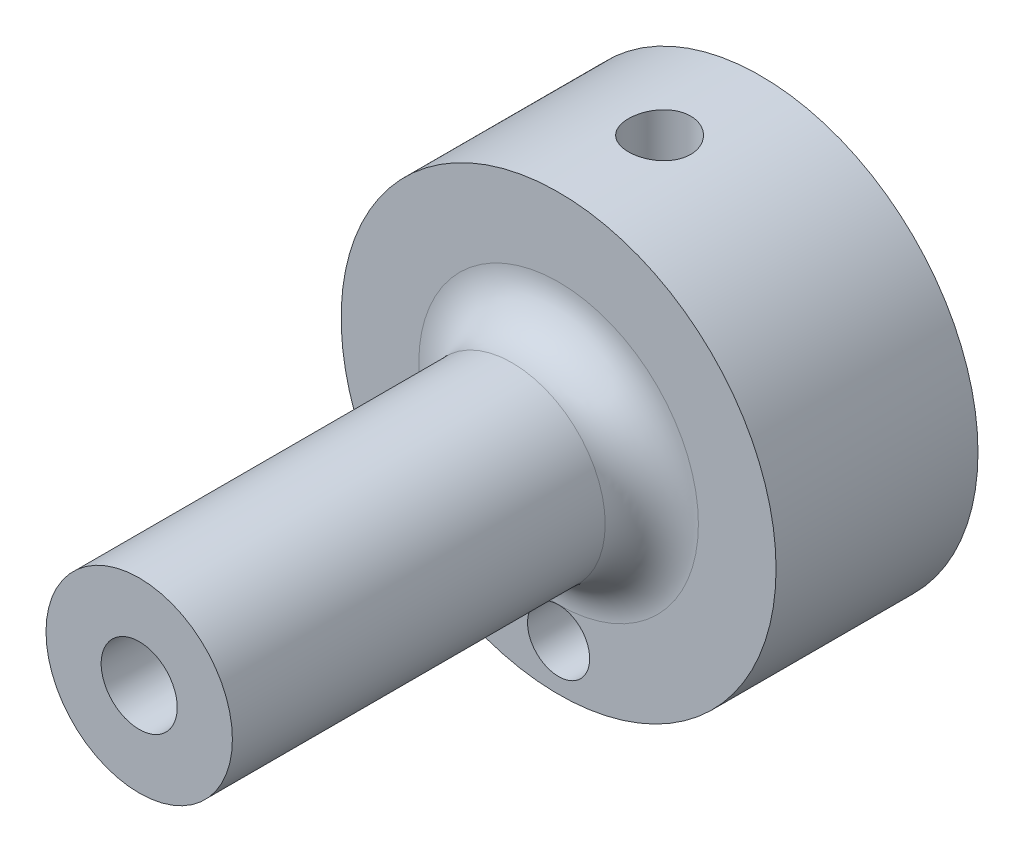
ISO-10303-21;
HEADER;
FILE_DESCRIPTION(('STEP AP214'),'2;1');
FILE_NAME('part.step','',(''),(''),'','','');
FILE_SCHEMA(('AUTOMOTIVE_DESIGN { 1 0 10303 214 1 1 1 1 }'));
ENDSEC;
DATA;
#1=APPLICATION_CONTEXT('core data for automotive mechanical design processes');
#2=APPLICATION_PROTOCOL_DEFINITION('international standard','automotive_design',2000,#1);
#3=PRODUCT_CONTEXT('',#1,'mechanical');
#4=PRODUCT('Part','Part','',(#3));
#5=PRODUCT_RELATED_PRODUCT_CATEGORY('part','',(#4));
#6=PRODUCT_DEFINITION_FORMATION('','',#4);
#7=PRODUCT_DEFINITION_CONTEXT('part definition',#1,'design');
#8=PRODUCT_DEFINITION('design','',#6,#7);
#9=PRODUCT_DEFINITION_SHAPE('','',#8);
#10=(LENGTH_UNIT() NAMED_UNIT(*) SI_UNIT(.MILLI.,.METRE.));
#11=(NAMED_UNIT(*) PLANE_ANGLE_UNIT() SI_UNIT($,.RADIAN.));
#12=(NAMED_UNIT(*) SI_UNIT($,.STERADIAN.) SOLID_ANGLE_UNIT());
#13=UNCERTAINTY_MEASURE_WITH_UNIT(LENGTH_MEASURE(1.E-05),#10,'distance_accuracy_value','');
#14=(GEOMETRIC_REPRESENTATION_CONTEXT(3) GLOBAL_UNCERTAINTY_ASSIGNED_CONTEXT((#13)) GLOBAL_UNIT_ASSIGNED_CONTEXT((#10,
#11,#12)) REPRESENTATION_CONTEXT('',''));
#15=CARTESIAN_POINT('',(0.,0.,0.));
#16=DIRECTION('',(0.,0.,1.));
#17=DIRECTION('',(1.,0.,0.));
#18=AXIS2_PLACEMENT_3D('',#15,#16,#17);
#19=CARTESIAN_POINT('',(0.,0.,27.));
#20=DIRECTION('',(0.,0.,1.));
#21=DIRECTION('',(1.,0.,0.));
#22=AXIS2_PLACEMENT_3D('',#19,#20,#21);
#23=CONICAL_SURFACE('',#22,2.4482025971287,0.0174532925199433);
#24=CARTESIAN_POINT('',(0.,0.,27.));
#25=DIRECTION('',(0.,0.,1.));
#26=DIRECTION('',(1.,0.,0.));
#27=AXIS2_PLACEMENT_3D('',#24,#25,#26);
#28=CIRCLE('',#27,2.4482025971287);
#29=CARTESIAN_POINT('',(2.4482025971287,0.,27.));
#30=VERTEX_POINT('',#29);
#31=EDGE_CURVE('E110',#30,#30,#28,.T.);
#32=ORIENTED_EDGE('',*,*,#31,.T.);
#33=EDGE_LOOP('',(#32));
#34=FACE_BOUND('',#33,.T.);
#35=CARTESIAN_POINT('',(0.,0.,-11.601899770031));
#36=DIRECTION('',(0.,0.,-1.));
#37=DIRECTION('',(-1.,0.,0.));
#38=AXIS2_PLACEMENT_3D('',#35,#36,#37);
#39=CIRCLE('',#38,1.77440393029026);
#40=CARTESIAN_POINT('',(0.,1.77440393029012,-11.601899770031));
#41=VERTEX_POINT('',#40);
#42=EDGE_CURVE('E38',#41,#41,#39,.F.);
#43=ORIENTED_EDGE('',*,*,#42,.F.);
#44=EDGE_LOOP('',(#43));
#45=FACE_BOUND('',#44,.T.);
#46=ADVANCED_FACE('F34',(#34,#45),#23,.F.);
#47=CARTESIAN_POINT('',(0.,0.,27.));
#48=DIRECTION('',(0.,0.,1.));
#49=DIRECTION('',(1.,0.,0.));
#50=AXIS2_PLACEMENT_3D('',#47,#48,#49);
#51=CYLINDRICAL_SURFACE('',#50,14.);
#52=CARTESIAN_POINT('',(0.,0.,0.));
#53=DIRECTION('',(0.,0.,1.));
#54=DIRECTION('',(1.,0.,0.));
#55=AXIS2_PLACEMENT_3D('',#52,#53,#54);
#56=CIRCLE('',#55,14.);
#57=CARTESIAN_POINT('',(14.,0.,0.));
#58=VERTEX_POINT('',#57);
#59=EDGE_CURVE('E104',#58,#58,#56,.T.);
#60=ORIENTED_EDGE('',*,*,#59,.F.);
#61=EDGE_LOOP('',(#60));
#62=FACE_BOUND('',#61,.T.);
#63=CARTESIAN_POINT('',(0.,0.,-13.));
#64=DIRECTION('',(0.,0.,1.));
#65=DIRECTION('',(1.,0.,0.));
#66=AXIS2_PLACEMENT_3D('',#63,#64,#65);
#67=CIRCLE('',#66,14.);
#68=CARTESIAN_POINT('',(14.,0.,-13.));
#69=VERTEX_POINT('',#68);
#70=EDGE_CURVE('E107',#69,#69,#67,.T.);
#71=ORIENTED_EDGE('',*,*,#70,.T.);
#72=EDGE_LOOP('',(#71));
#73=FACE_BOUND('',#72,.T.);
#74=CARTESIAN_POINT('',(0.,14.,-4.5));
#75=CARTESIAN_POINT('',(0.111730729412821,13.9999982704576,-4.50000465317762));
#76=CARTESIAN_POINT('',(0.223527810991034,13.9986484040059,-4.50939441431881));
#77=CARTESIAN_POINT('',(0.444001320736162,13.9933934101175,-4.54669827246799));
#78=CARTESIAN_POINT('',(0.552674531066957,13.9894857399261,-4.57463080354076));
#79=CARTESIAN_POINT('',(0.763677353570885,13.9795546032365,-4.64817212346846));
#80=CARTESIAN_POINT('',(0.866011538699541,13.9735326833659,-4.69376799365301));
#81=CARTESIAN_POINT('',(1.06155930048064,13.9600397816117,-4.80131108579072));
#82=CARTESIAN_POINT('',(1.1547742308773,13.9525690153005,-4.86325587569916));
#83=CARTESIAN_POINT('',(1.33011730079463,13.9369507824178,-5.00220834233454));
#84=CARTESIAN_POINT('',(1.4121711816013,13.9287993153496,-5.07930928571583));
#85=CARTESIAN_POINT('',(1.56222258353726,13.9127699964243,-5.24618482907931));
#86=CARTESIAN_POINT('',(1.63021932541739,13.9048921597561,-5.33596013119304));
#87=CARTESIAN_POINT('',(1.75051175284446,13.8902631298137,-5.52613023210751));
#88=CARTESIAN_POINT('',(1.80273625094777,13.8835171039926,-5.62657049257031));
#89=CARTESIAN_POINT('',(1.8895469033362,13.8719696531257,-5.83490907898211));
#90=CARTESIAN_POINT('',(1.92413392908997,13.8671681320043,-5.94280703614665));
#91=CARTESIAN_POINT('',(1.97445864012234,13.8600923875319,-6.16222001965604));
#92=CARTESIAN_POINT('',(1.99032297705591,13.8578011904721,-6.27370543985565));
#93=CARTESIAN_POINT('',(2.00314420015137,13.8559538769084,-6.4977778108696));
#94=CARTESIAN_POINT('',(2.00010207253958,13.8563976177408,-6.61036470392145));
#95=CARTESIAN_POINT('',(1.97530036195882,13.8599545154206,-6.83255309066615));
#96=CARTESIAN_POINT('',(1.95368136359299,13.8630476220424,-6.94217064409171));
#97=CARTESIAN_POINT('',(1.89255944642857,13.8715234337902,-7.15620617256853));
#98=CARTESIAN_POINT('',(1.85305606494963,13.8769061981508,-7.26062401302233));
#99=CARTESIAN_POINT('',(1.75713904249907,13.8893771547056,-7.46172654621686));
#100=CARTESIAN_POINT('',(1.70066538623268,13.8964713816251,-7.55838222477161));
#101=CARTESIAN_POINT('',(1.57245369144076,13.9115614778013,-7.7408984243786));
#102=CARTESIAN_POINT('',(1.50071474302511,13.9195574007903,-7.82675830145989));
#103=CARTESIAN_POINT('',(1.34323491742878,13.935638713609,-7.98606080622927));
#104=CARTESIAN_POINT('',(1.25737307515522,13.9437242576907,-8.05938389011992));
#105=CARTESIAN_POINT('',(1.07449831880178,13.9590063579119,-8.19059700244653));
#106=CARTESIAN_POINT('',(0.97748536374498,13.9662029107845,-8.24848697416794));
#107=CARTESIAN_POINT('',(0.774962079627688,13.9789027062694,-8.34719487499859));
#108=CARTESIAN_POINT('',(0.66944745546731,13.9844050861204,-8.38800410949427));
#109=CARTESIAN_POINT('',(0.452966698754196,13.9930891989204,-8.4512909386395));
#110=CARTESIAN_POINT('',(0.342000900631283,13.9962710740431,-8.47376965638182));
#111=CARTESIAN_POINT('',(0.118800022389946,13.9999369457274,-8.49959962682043));
#112=CARTESIAN_POINT('',(0.00658433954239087,14.0004441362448,-8.5031153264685));
#113=CARTESIAN_POINT('',(-0.216834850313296,13.998766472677,-8.49135519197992));
#114=CARTESIAN_POINT('',(-0.328038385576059,13.9965816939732,-8.47607988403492));
#115=CARTESIAN_POINT('',(-0.545782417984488,13.989779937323,-8.42730805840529));
#116=CARTESIAN_POINT('',(-0.652341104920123,13.9851735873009,-8.39389114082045));
#117=CARTESIAN_POINT('',(-0.858342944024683,13.9740437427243,-8.30986826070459));
#118=CARTESIAN_POINT('',(-0.957785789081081,13.9675201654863,-8.25926155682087));
#119=CARTESIAN_POINT('',(-1.14745969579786,13.9532237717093,-8.14190618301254));
#120=CARTESIAN_POINT('',(-1.23762521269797,13.9454429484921,-8.07505257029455));
#121=CARTESIAN_POINT('',(-1.40551529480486,13.9295244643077,-7.92724792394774));
#122=CARTESIAN_POINT('',(-1.48323920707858,13.9213867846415,-7.84629615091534));
#123=CARTESIAN_POINT('',(-1.62463364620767,13.905598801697,-7.67186329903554));
#124=CARTESIAN_POINT('',(-1.68819430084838,13.8979526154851,-7.57829272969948));
#125=CARTESIAN_POINT('',(-1.79869568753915,13.8840847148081,-7.38170681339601));
#126=CARTESIAN_POINT('',(-1.84563683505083,13.8778629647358,-7.27869170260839));
#127=CARTESIAN_POINT('',(-1.92139410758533,13.8675777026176,-7.06647669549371));
#128=CARTESIAN_POINT('',(-1.95026930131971,13.8635071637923,-6.95729824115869));
#129=CARTESIAN_POINT('',(-1.98926373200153,13.8579660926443,-6.7355794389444));
#130=CARTESIAN_POINT('',(-1.99938413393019,13.8564953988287,-6.62303930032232));
#131=CARTESIAN_POINT('',(-2.00055590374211,13.8563261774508,-6.39888617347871));
#132=CARTESIAN_POINT('',(-1.99177997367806,13.8576025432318,-6.28727406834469));
#133=CARTESIAN_POINT('',(-1.955776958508,13.8627292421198,-6.06712987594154));
#134=CARTESIAN_POINT('',(-1.92854989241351,13.8665795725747,-5.95859778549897));
#135=CARTESIAN_POINT('',(-1.85647645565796,13.8764118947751,-5.74773473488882));
#136=CARTESIAN_POINT('',(-1.81164102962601,13.8823925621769,-5.64539996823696));
#137=CARTESIAN_POINT('',(-1.70564064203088,13.8958134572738,-5.4496775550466));
#138=CARTESIAN_POINT('',(-1.6444752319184,13.9032537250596,-5.35629015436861));
#139=CARTESIAN_POINT('',(-1.50691947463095,13.9188366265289,-5.18023418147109));
#140=CARTESIAN_POINT('',(-1.43040092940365,13.9269848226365,-5.09766625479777));
#141=CARTESIAN_POINT('',(-1.26458151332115,13.9430182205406,-4.94648029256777));
#142=CARTESIAN_POINT('',(-1.17527766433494,13.9509033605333,-4.87786551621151));
#143=CARTESIAN_POINT('',(-0.985903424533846,13.9655666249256,-4.75623242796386));
#144=CARTESIAN_POINT('',(-0.885781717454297,13.9723390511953,-4.70329334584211));
#145=CARTESIAN_POINT('',(-0.678021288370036,13.9839575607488,-4.6150602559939));
#146=CARTESIAN_POINT('',(-0.570390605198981,13.9888056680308,-4.57974769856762));
#147=CARTESIAN_POINT('',(-0.385211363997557,13.9949036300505,-4.53591641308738));
#148=CARTESIAN_POINT('',(-0.308813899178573,13.9968051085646,-4.52246796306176));
#149=CARTESIAN_POINT('',(-0.154954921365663,13.9993538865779,-4.5045081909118));
#150=CARTESIAN_POINT('',(-0.0774934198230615,14.0000011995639,-4.49999677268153));
#151=CARTESIAN_POINT('',(0.,14.,-4.5));
#152=B_SPLINE_CURVE_WITH_KNOTS('',3,(#74,#75,#76,#77,#78,#79,#80,#81,#82,#83,#84,#85,#86,#87,
#88,#89,#90,#91,#92,#93,#94,#95,#96,#97,#98,#99,#100,#101,#102,#103,#104,#105,#106,#107,#108,
#109,#110,#111,#112,#113,#114,#115,#116,#117,#118,#119,#120,#121,#122,#123,#124,#125,#126,#127,
#128,#129,#130,#131,#132,#133,#134,#135,#136,#137,#138,#139,#140,#141,#142,#143,#144,#145,#146,
#147,#148,#149,#150,#151),.UNSPECIFIED.,.T.,.F.,(4,2,2,2,2,2,2,2,2,2,2,2,2,2,2,2,2,2,2,2,2,2,2,
2,2,2,2,2,2,2,2,2,2,2,2,2,2,2,4),(0.,0.334909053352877,0.670151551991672,1.0051493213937,
1.34009728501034,1.67717486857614,2.01427113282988,2.35286688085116,2.69144589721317,
3.02772118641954,3.36397893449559,3.69771416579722,4.03145803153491,4.36639635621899,
4.70135465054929,5.03934756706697,5.37734172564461,5.71550772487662,6.05365300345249,
6.38886112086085,6.7240598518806,7.05779957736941,7.39155369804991,7.7275237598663,
8.06351144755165,8.40202124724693,8.74052258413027,9.0779112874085,9.41527903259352,
9.74957651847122,10.0838736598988,10.4179633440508,10.7520622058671,11.0890764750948,
11.4261693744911,11.7649380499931,12.1033494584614,12.3356358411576,12.5679197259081),.UNSPECIFIED.);
#153=CARTESIAN_POINT('',(0.,14.,-4.5));
#154=VERTEX_POINT('',#153);
#155=EDGE_CURVE('E11',#154,#154,#152,.T.);
#156=ORIENTED_EDGE('',*,*,#155,.F.);
#157=EDGE_LOOP('',(#156));
#158=FACE_BOUND('',#157,.T.);
#159=ADVANCED_FACE('F71',(#62,#73,#158),#51,.T.);
#160=CARTESIAN_POINT('',(0.,6.,27.));
#161=DIRECTION('',(0.,0.,-1.));
#162=DIRECTION('',(-1.,0.,0.));
#163=AXIS2_PLACEMENT_3D('',#160,#161,#162);
#164=PLANE('',#163);
#165=ORIENTED_EDGE('',*,*,#31,.F.);
#166=EDGE_LOOP('',(#165));
#167=FACE_BOUND('',#166,.T.);
#168=CARTESIAN_POINT('',(0.,0.,27.));
#169=DIRECTION('',(0.,0.,1.));
#170=DIRECTION('',(1.,0.,0.));
#171=AXIS2_PLACEMENT_3D('',#168,#169,#170);
#172=CIRCLE('',#171,6.);
#173=CARTESIAN_POINT('',(6.,0.,27.));
#174=VERTEX_POINT('',#173);
#175=EDGE_CURVE('E43',#174,#174,#172,.T.);
#176=ORIENTED_EDGE('',*,*,#175,.T.);
#177=EDGE_LOOP('',(#176));
#178=FACE_BOUND('',#177,.T.);
#179=ADVANCED_FACE('F36',(#167,#178),#164,.F.);
#180=CARTESIAN_POINT('',(0.,0.,27.));
#181=DIRECTION('',(0.,0.,1.));
#182=DIRECTION('',(1.,0.,0.));
#183=AXIS2_PLACEMENT_3D('',#180,#181,#182);
#184=CYLINDRICAL_SURFACE('',#183,6.);
#185=ORIENTED_EDGE('',*,*,#175,.F.);
#186=EDGE_LOOP('',(#185));
#187=FACE_BOUND('',#186,.T.);
#188=CARTESIAN_POINT('',(0.,0.,3.));
#189=DIRECTION('',(0.,0.,1.));
#190=DIRECTION('',(1.,0.,0.));
#191=AXIS2_PLACEMENT_3D('',#188,#189,#190);
#192=CIRCLE('',#191,6.);
#193=CARTESIAN_POINT('',(6.,0.,3.));
#194=VERTEX_POINT('',#193);
#195=EDGE_CURVE('E98',#194,#194,#192,.T.);
#196=ORIENTED_EDGE('',*,*,#195,.T.);
#197=EDGE_LOOP('',(#196));
#198=FACE_BOUND('',#197,.T.);
#199=ADVANCED_FACE('F179',(#187,#198),#184,.T.);
#200=CARTESIAN_POINT('',(0.,0.,3.));
#201=DIRECTION('',(0.,0.,1.));
#202=DIRECTION('',(1.,0.,0.));
#203=AXIS2_PLACEMENT_3D('',#200,#201,#202);
#204=TOROIDAL_SURFACE('',#203,9.,3.);
#205=ORIENTED_EDGE('',*,*,#195,.F.);
#206=EDGE_LOOP('',(#205));
#207=FACE_BOUND('',#206,.T.);
#208=CARTESIAN_POINT('',(0.,0.,0.));
#209=DIRECTION('',(0.,0.,1.));
#210=DIRECTION('',(1.,0.,0.));
#211=AXIS2_PLACEMENT_3D('',#208,#209,#210);
#212=CIRCLE('',#211,9.00000000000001);
#213=CARTESIAN_POINT('',(0.,-9.00000000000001,0.));
#214=VERTEX_POINT('',#213);
#215=EDGE_CURVE('E101',#214,#214,#212,.T.);
#216=ORIENTED_EDGE('',*,*,#215,.T.);
#217=EDGE_LOOP('',(#216));
#218=FACE_BOUND('',#217,.T.);
#219=ADVANCED_FACE('F175',(#207,#218),#204,.F.);
#220=CARTESIAN_POINT('',(0.,14.,0.));
#221=DIRECTION('',(0.,0.,-1.));
#222=DIRECTION('',(-1.,0.,0.));
#223=AXIS2_PLACEMENT_3D('',#220,#221,#222);
#224=PLANE('',#223);
#225=ORIENTED_EDGE('',*,*,#215,.F.);
#226=CARTESIAN_POINT('',(0.,-11.,0.));
#227=DIRECTION('',(0.,0.,1.));
#228=DIRECTION('',(1.,0.,0.));
#229=AXIS2_PLACEMENT_3D('',#226,#227,#228);
#230=CIRCLE('',#229,2.);
#231=EDGE_CURVE('E48',#214,#214,#230,.T.);
#232=ORIENTED_EDGE('',*,*,#231,.F.);
#233=EDGE_LOOP('',(#225,#232));
#234=FACE_BOUND('',#233,.T.);
#235=ORIENTED_EDGE('',*,*,#59,.T.);
#236=EDGE_LOOP('',(#235));
#237=FACE_BOUND('',#236,.T.);
#238=ADVANCED_FACE('F88',(#234,#237),#224,.F.);
#239=CARTESIAN_POINT('',(0.,1.75,-13.));
#240=DIRECTION('',(0.,0.,1.));
#241=DIRECTION('',(1.,0.,0.));
#242=AXIS2_PLACEMENT_3D('',#239,#240,#241);
#243=PLANE('',#242);
#244=CARTESIAN_POINT('',(0.,0.,-13.));
#245=DIRECTION('',(0.,0.,1.));
#246=DIRECTION('',(1.,0.,0.));
#247=AXIS2_PLACEMENT_3D('',#244,#245,#246);
#248=CIRCLE('',#247,6.65206734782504);
#249=CARTESIAN_POINT('',(0.,6.65206734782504,-13.));
#250=VERTEX_POINT('',#249);
#251=EDGE_CURVE('E118',#250,#250,#248,.T.);
#252=ORIENTED_EDGE('',*,*,#251,.T.);
#253=EDGE_LOOP('',(#252));
#254=FACE_BOUND('',#253,.T.);
#255=ORIENTED_EDGE('',*,*,#70,.F.);
#256=EDGE_LOOP('',(#255));
#257=FACE_BOUND('',#256,.T.);
#258=ADVANCED_FACE('F86',(#254,#257),#243,.F.);
#259=CARTESIAN_POINT('',(0.,14.,-6.5));
#260=DIRECTION('',(0.,1.,0.));
#261=DIRECTION('',(0.,0.,1.));
#262=AXIS2_PLACEMENT_3D('',#259,#260,#261);
#263=CYLINDRICAL_SURFACE('',#262,2.);
#264=CARTESIAN_POINT('',(0.,8.,-6.5));
#265=DIRECTION('',(0.,1.,0.));
#266=DIRECTION('',(0.,0.,1.));
#267=AXIS2_PLACEMENT_3D('',#264,#265,#266);
#268=CIRCLE('',#267,2.);
#269=CARTESIAN_POINT('',(0.,8.,-4.5));
#270=VERTEX_POINT('',#269);
#271=EDGE_CURVE('E112',#270,#270,#268,.T.);
#272=ORIENTED_EDGE('',*,*,#271,.F.);
#273=EDGE_LOOP('',(#272));
#274=FACE_BOUND('',#273,.T.);
#275=ORIENTED_EDGE('',*,*,#155,.T.);
#276=EDGE_LOOP('',(#275));
#277=FACE_BOUND('',#276,.T.);
#278=ADVANCED_FACE('F83',(#274,#277),#263,.F.);
#279=CARTESIAN_POINT('',(0.,6.79827876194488,-6.5));
#280=DIRECTION('',(0.,1.,0.));
#281=DIRECTION('',(0.,0.,1.));
#282=AXIS2_PLACEMENT_3D('',#279,#280,#281);
#283=CONICAL_SURFACE('',#282,0.,1.02974425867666);
#284=ORIENTED_EDGE('',*,*,#271,.T.);
#285=EDGE_LOOP('',(#284));
#286=FACE_BOUND('',#285,.T.);
#287=CARTESIAN_POINT('',(0.,6.79827876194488,-6.5));
#288=VERTEX_POINT('',#287);
#289=VERTEX_LOOP('',#288);
#290=FACE_BOUND('',#289,.T.);
#291=ADVANCED_FACE('F67',(#286,#290),#283,.F.);
#292=CARTESIAN_POINT('',(0.,-11.,0.));
#293=DIRECTION('',(0.,0.,1.));
#294=DIRECTION('',(1.,0.,0.));
#295=AXIS2_PLACEMENT_3D('',#292,#293,#294);
#296=CYLINDRICAL_SURFACE('',#295,2.);
#297=ORIENTED_EDGE('',*,*,#231,.T.);
#298=EDGE_LOOP('',(#297));
#299=FACE_BOUND('',#298,.T.);
#300=CARTESIAN_POINT('',(0.,-11.,-6.00000000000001));
#301=DIRECTION('',(0.,0.,1.));
#302=DIRECTION('',(1.,0.,0.));
#303=AXIS2_PLACEMENT_3D('',#300,#301,#302);
#304=CIRCLE('',#303,2.);
#305=CARTESIAN_POINT('',(2.,-11.,-6.00000000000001));
#306=VERTEX_POINT('',#305);
#307=EDGE_CURVE('E116',#306,#306,#304,.T.);
#308=ORIENTED_EDGE('',*,*,#307,.F.);
#309=EDGE_LOOP('',(#308));
#310=FACE_BOUND('',#309,.T.);
#311=ADVANCED_FACE('F58',(#299,#310),#296,.F.);
#312=CARTESIAN_POINT('',(0.,-11.,-7.20172123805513));
#313=DIRECTION('',(0.,0.,1.));
#314=DIRECTION('',(1.,0.,0.));
#315=AXIS2_PLACEMENT_3D('',#312,#313,#314);
#316=CONICAL_SURFACE('',#315,0.,1.02974425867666);
#317=ORIENTED_EDGE('',*,*,#307,.T.);
#318=EDGE_LOOP('',(#317));
#319=FACE_BOUND('',#318,.T.);
#320=CARTESIAN_POINT('',(0.,-11.,-7.20172123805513));
#321=VERTEX_POINT('',#320);
#322=VERTEX_LOOP('',#321);
#323=FACE_BOUND('',#322,.T.);
#324=ADVANCED_FACE('F55',(#319,#323),#316,.F.);
#325=CARTESIAN_POINT('',(0.,0.,-27.));
#326=DIRECTION('',(0.,0.,1.));
#327=DIRECTION('',(0.,1.,0.));
#328=AXIS2_PLACEMENT_3D('',#325,#326,#327);
#329=SPHERICAL_SURFACE('',#328,15.5);
#330=CARTESIAN_POINT('',(0.,6.65206734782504,-13.));
#331=CARTESIAN_POINT('',(0.,6.60411157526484,-12.9772139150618));
#332=CARTESIAN_POINT('',(0.,6.55603871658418,-12.9546742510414));
#333=CARTESIAN_POINT('',(0.,6.45966392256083,-12.9100901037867));
#334=CARTESIAN_POINT('',(0.,6.41136198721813,-12.8880456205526));
#335=CARTESIAN_POINT('',(0.,6.31453413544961,-12.8444541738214));
#336=CARTESIAN_POINT('',(0.,6.26600821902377,-12.8229072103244));
#337=CARTESIAN_POINT('',(0.,6.16873753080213,-12.7803130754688));
#338=CARTESIAN_POINT('',(0.,6.11999275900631,-12.7592659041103));
#339=CARTESIAN_POINT('',(0.,6.02228950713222,-12.7176735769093));
#340=CARTESIAN_POINT('',(0.,5.97333102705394,-12.6971284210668));
#341=CARTESIAN_POINT('',(0.,5.87520552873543,-12.6565422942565));
#342=CARTESIAN_POINT('',(0.,5.82603851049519,-12.6365013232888));
#343=CARTESIAN_POINT('',(0.,5.72750112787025,-12.5969256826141));
#344=CARTESIAN_POINT('',(0.,5.67813076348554,-12.5773910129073));
#345=CARTESIAN_POINT('',(0.,5.5791919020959,-12.538830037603));
#346=CARTESIAN_POINT('',(0.,5.52962340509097,-12.5198037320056));
#347=CARTESIAN_POINT('',(0.,5.43029351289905,-12.4822614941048));
#348=CARTESIAN_POINT('',(0.,5.38053211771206,-12.4637455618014));
#349=CARTESIAN_POINT('',(0.,5.28082168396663,-12.4272260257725));
#350=CARTESIAN_POINT('',(0.,5.23087264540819,-12.409222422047));
#351=CARTESIAN_POINT('',(0.,5.13079219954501,-12.3737294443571));
#352=CARTESIAN_POINT('',(0.,5.08066079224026,-12.3562400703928));
#353=CARTESIAN_POINT('',(0.,4.98022090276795,-12.3217773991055));
#354=CARTESIAN_POINT('',(0.,4.92991242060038,-12.3048041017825));
#355=CARTESIAN_POINT('',(0.,4.82912369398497,-12.2713753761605));
#356=CARTESIAN_POINT('',(0.,4.77864344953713,-12.2549199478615));
#357=CARTESIAN_POINT('',(0.,4.67751652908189,-12.2225286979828));
#358=CARTESIAN_POINT('',(0.,4.62686985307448,-12.2065928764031));
#359=CARTESIAN_POINT('',(0.,4.52541541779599,-12.175242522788));
#360=CARTESIAN_POINT('',(0.,4.4746076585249,-12.1598279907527));
#361=CARTESIAN_POINT('',(0.,4.37283642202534,-12.1295218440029));
#362=CARTESIAN_POINT('',(0.,4.32187294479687,-12.1146302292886));
#363=CARTESIAN_POINT('',(0.,4.21979565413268,-12.0853714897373));
#364=CARTESIAN_POINT('',(0.,4.16868184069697,-12.0710043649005));
#365=CARTESIAN_POINT('',(0.,4.06630927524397,-12.0427961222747));
#366=CARTESIAN_POINT('',(0.,4.01505052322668,-12.0289550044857));
#367=CARTESIAN_POINT('',(0.,3.91239349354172,-12.0018002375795));
#368=CARTESIAN_POINT('',(0.,3.86099521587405,-11.9884865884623));
#369=CARTESIAN_POINT('',(0.,3.75806456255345,-11.9623881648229));
#370=CARTESIAN_POINT('',(0.,3.70653218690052,-11.9496033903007));
#371=CARTESIAN_POINT('',(0.,3.6033387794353,-11.9245640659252));
#372=CARTESIAN_POINT('',(0.,3.55167774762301,-11.9123095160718));
#373=CARTESIAN_POINT('',(0.,3.44823248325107,-11.8883319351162));
#374=CARTESIAN_POINT('',(0.,3.39644825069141,-11.8766089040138));
#375=CARTESIAN_POINT('',(0.,3.29276205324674,-11.853695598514));
#376=CARTESIAN_POINT('',(0.,3.24086008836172,-11.8425053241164));
#377=CARTESIAN_POINT('',(0.,3.13694390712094,-11.8206587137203));
#378=CARTESIAN_POINT('',(0.,3.08492969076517,-11.8100023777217));
#379=CARTESIAN_POINT('',(0.,2.98079449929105,-11.7892247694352));
#380=CARTESIAN_POINT('',(0.,2.92867352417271,-11.7791034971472));
#381=CARTESIAN_POINT('',(0.,2.82433031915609,-11.7593970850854));
#382=CARTESIAN_POINT('',(0.,2.77210808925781,-11.7498119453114));
#383=CARTESIAN_POINT('',(0.,2.66756788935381,-11.7311788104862));
#384=CARTESIAN_POINT('',(0.,2.61524991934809,-11.7221308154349));
#385=CARTESIAN_POINT('',(0.,2.5105237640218,-11.7045729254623));
#386=CARTESIAN_POINT('',(0.,2.45811557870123,-11.6960630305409));
#387=CARTESIAN_POINT('',(0.,2.35321452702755,-11.6795822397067));
#388=CARTESIAN_POINT('',(0.,2.30072166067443,-11.6716113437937));
#389=CARTESIAN_POINT('',(0.,2.19565679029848,-11.6562093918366));
#390=CARTESIAN_POINT('',(0.,2.14308478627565,-11.6487783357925));
#391=CARTESIAN_POINT('',(0.,2.0378671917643,-11.6344568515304));
#392=CARTESIAN_POINT('',(0.,1.98522160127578,-11.6275664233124));
#393=CARTESIAN_POINT('',(0.,1.87986239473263,-11.6143269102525));
#394=CARTESIAN_POINT('',(0.,1.82714877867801,-11.6079778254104));
#395=CARTESIAN_POINT('',(0.,1.77440393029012,-11.601899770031));
#396=B_SPLINE_CURVE_WITH_KNOTS('',3,(#330,#331,#332,#333,#334,#335,#336,#337,#338,#339,#340,
#341,#342,#343,#344,#345,#346,#347,#348,#349,#350,#351,#352,#353,#354,#355,#356,#357,#358,#359,
#360,#361,#362,#363,#364,#365,#366,#367,#368,#369,#370,#371,#372,#373,#374,#375,#376,#377,#378,
#379,#380,#381,#382,#383,#384,#385,#386,#387,#388,#389,#390,#391,#392,#393,#394,#395),
.UNSPECIFIED.,.F.,.F.,(4,2,2,2,2,2,2,2,2,2,2,2,2,2,2,2,2,2,2,2,2,2,2,2,2,2,2,2,2,2,2,2,4),(0.,
0.159280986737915,0.318561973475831,0.477842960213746,0.637123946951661,0.796404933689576,
0.955685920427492,1.11496690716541,1.27424789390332,1.43352888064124,1.59280986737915,
1.75209085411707,1.91137184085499,2.0706528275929,2.22993381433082,2.38921480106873,
2.54849578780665,2.70777677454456,2.86705776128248,3.02633874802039,3.18561973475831,
3.34490072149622,3.50418170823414,3.66346269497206,3.82274368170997,3.98202466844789,
4.1413056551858,4.30058664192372,4.45986762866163,4.61914861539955,4.77842960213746,
4.93771058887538,5.09699157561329),.UNSPECIFIED.);
#397=EDGE_CURVE('BSEAM57',#250,#41,#396,.T.);
#398=ORIENTED_EDGE('',*,*,#251,.F.);
#399=ORIENTED_EDGE('',*,*,#42,.T.);
#400=ORIENTED_EDGE('',*,*,#397,.T.);
#401=ORIENTED_EDGE('',*,*,#397,.F.);
#402=EDGE_LOOP('',(#398,#400,#399,#401));
#403=FACE_BOUND('',#402,.T.);
#404=ADVANCED_FACE('F57',(#403),#329,.F.);
#405=CLOSED_SHELL('',(#46,#159,#179,#199,#219,#238,#258,#278,#291,#311,#324,#404));
#406=MANIFOLD_SOLID_BREP('B2',#405);
#407=ADVANCED_BREP_SHAPE_REPRESENTATION('',(#18,#406),#14);
#408=SHAPE_DEFINITION_REPRESENTATION(#9,#407);
ENDSEC;
END-ISO-10303-21;
